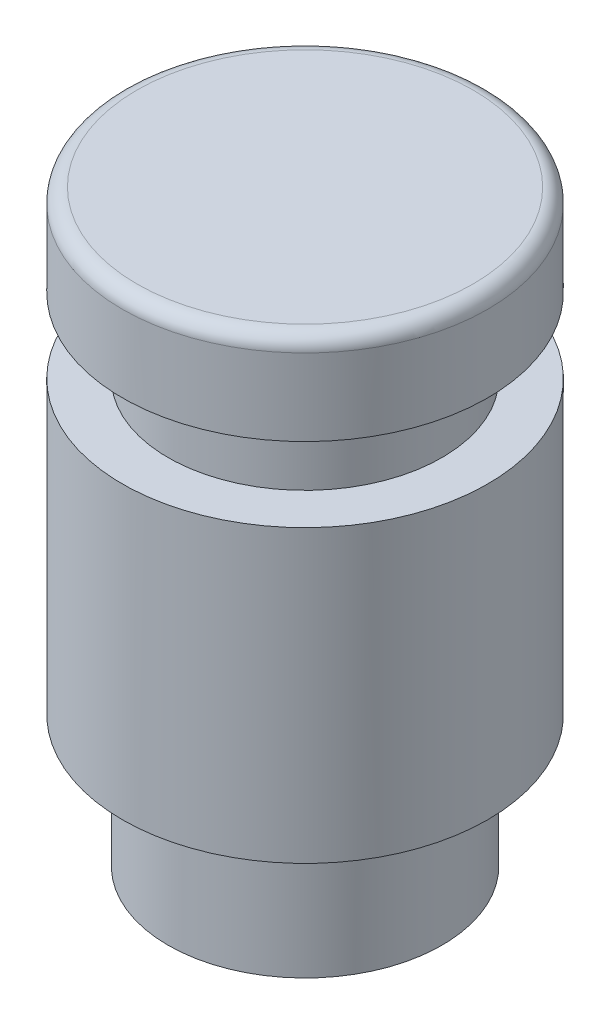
from build123d import *

# Parameters (mm, degrees)
SKETCH1_R           = 3.175
BOSS_EXTRUDE1_DEPTH = 7.9375
SKETCH3_W           = 0.79375
SKETCH3_H           = 1.2954
BOSS_EXTRUDE2_START = 2.286
SKETCH4_R           = 2.38125
BOSS_EXTRUDE2_DEPTH = 2.286
FILLET2_R           = 0.254


with BuildPart() as part:
    # Sketch1 → Boss-Extrude1 (new body)
    with BuildSketch(Plane(origin=(0, 0, 0), x_dir=(1, 0, 0), z_dir=(0, 1, 0))):
        with Locations(Location((0, 0, 0), (0, 0, 270))):
            Circle(SKETCH1_R)
    extrude(amount=BOSS_EXTRUDE1_DEPTH)

    # Sketch3 → Cut-Revolve1 (revolve, cut)
    with BuildSketch(Plane(origin=(0, 0, 0), x_dir=(0, 0, -1), z_dir=(1, 0, 0))):
        with Locations((2.778125, 5.7023)):
            Rectangle(SKETCH3_W, SKETCH3_H)
    revolve(axis=Axis((0, 0, 0), (0, 1, 0)), mode=Mode.SUBTRACT)

    # Sketch4 → Boss-Extrude2 (add)
    with BuildSketch(Plane.XZ.offset(BOSS_EXTRUDE2_START)):
        with Locations(Location((0, 0, 0), (0, 0, 270))):
            Circle(SKETCH4_R)
    extrude(amount=-BOSS_EXTRUDE2_DEPTH)

    # Fillet2
    fillet2_edges = [part.edges().sort_by_distance(p)[0] for p in [
        (0, 7.9375, -3.175),
    ]]
    fillet(fillet2_edges, radius=FILLET2_R)


solid = part.part
